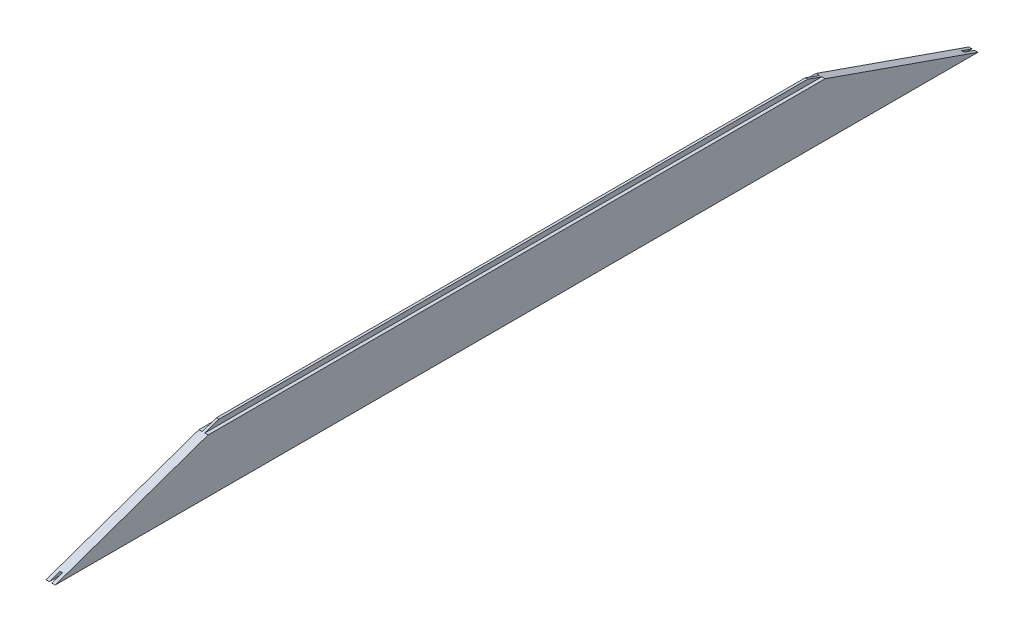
ISO-10303-21;
HEADER;
FILE_DESCRIPTION(('STEP AP214'),'2;1');
FILE_NAME('part.step','',(''),(''),'','','');
FILE_SCHEMA(('AUTOMOTIVE_DESIGN { 1 0 10303 214 1 1 1 1 }'));
ENDSEC;
DATA;
#1=APPLICATION_CONTEXT('core data for automotive mechanical design processes');
#2=APPLICATION_PROTOCOL_DEFINITION('international standard','automotive_design',2000,#1);
#3=PRODUCT_CONTEXT('',#1,'mechanical');
#4=PRODUCT('Part','Part','',(#3));
#5=PRODUCT_RELATED_PRODUCT_CATEGORY('part','',(#4));
#6=PRODUCT_DEFINITION_FORMATION('','',#4);
#7=PRODUCT_DEFINITION_CONTEXT('part definition',#1,'design');
#8=PRODUCT_DEFINITION('design','',#6,#7);
#9=PRODUCT_DEFINITION_SHAPE('','',#8);
#10=(LENGTH_UNIT() NAMED_UNIT(*) SI_UNIT(.MILLI.,.METRE.));
#11=(NAMED_UNIT(*) PLANE_ANGLE_UNIT() SI_UNIT($,.RADIAN.));
#12=(NAMED_UNIT(*) SI_UNIT($,.STERADIAN.) SOLID_ANGLE_UNIT());
#13=UNCERTAINTY_MEASURE_WITH_UNIT(LENGTH_MEASURE(1.E-05),#10,'distance_accuracy_value','');
#14=(GEOMETRIC_REPRESENTATION_CONTEXT(3) GLOBAL_UNCERTAINTY_ASSIGNED_CONTEXT((#13)) GLOBAL_UNIT_ASSIGNED_CONTEXT((#10,
#11,#12)) REPRESENTATION_CONTEXT('',''));
#15=CARTESIAN_POINT('',(0.,0.,0.));
#16=DIRECTION('',(0.,0.,1.));
#17=DIRECTION('',(1.,0.,0.));
#18=AXIS2_PLACEMENT_3D('',#15,#16,#17);
#19=CARTESIAN_POINT('',(0.,43.5,1500.));
#20=DIRECTION('',(0.,1.,0.));
#21=DIRECTION('',(0.,0.,1.));
#22=AXIS2_PLACEMENT_3D('',#19,#20,#21);
#23=PLANE('',#22);
#24=DIRECTION('',(0.,0.,-1.));
#25=VECTOR('',#24,1.);
#26=CARTESIAN_POINT('',(7.5,43.5,1500.));
#27=LINE('',#26,#25);
#28=CARTESIAN_POINT('',(7.50000000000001,43.5,1251.42792834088));
#29=VERTEX_POINT('',#28);
#30=CARTESIAN_POINT('',(7.50000000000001,43.5,248.572071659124));
#31=VERTEX_POINT('',#30);
#32=EDGE_CURVE('E199',#29,#31,#27,.T.);
#33=ORIENTED_EDGE('',*,*,#32,.T.);
#34=DIRECTION('',(-1.,0.,0.));
#35=VECTOR('',#34,1.);
#36=CARTESIAN_POINT('',(0.,43.5,248.572071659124));
#37=LINE('',#36,#35);
#38=CARTESIAN_POINT('',(2.,43.5,248.572071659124));
#39=VERTEX_POINT('',#38);
#40=EDGE_CURVE('E171',#31,#39,#37,.T.);
#41=ORIENTED_EDGE('',*,*,#40,.T.);
#42=DIRECTION('',(0.,0.,-1.));
#43=VECTOR('',#42,1.);
#44=CARTESIAN_POINT('',(2.,43.5,1500.));
#45=LINE('',#44,#43);
#46=CARTESIAN_POINT('',(2.,43.5,1251.42792834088));
#47=VERTEX_POINT('',#46);
#48=EDGE_CURVE('E11',#47,#39,#45,.T.);
#49=ORIENTED_EDGE('',*,*,#48,.F.);
#50=DIRECTION('',(-1.,0.,0.));
#51=VECTOR('',#50,1.);
#52=CARTESIAN_POINT('',(0.,43.5,1251.42792834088));
#53=LINE('',#52,#51);
#54=EDGE_CURVE('E128',#29,#47,#53,.T.);
#55=ORIENTED_EDGE('',*,*,#54,.F.);
#56=EDGE_LOOP('',(#33,#41,#49,#55));
#57=FACE_BOUND('',#56,.T.);
#58=ADVANCED_FACE('F32',(#57),#23,.T.);
#59=CARTESIAN_POINT('',(2.00000000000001,0.,1500.));
#60=DIRECTION('',(1.,0.,0.));
#61=DIRECTION('',(0.,1.,0.));
#62=AXIS2_PLACEMENT_3D('',#59,#60,#61);
#63=PLANE('',#62);
#64=ORIENTED_EDGE('',*,*,#48,.T.);
#65=DIRECTION('',(0.,0.330349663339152,0.943858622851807));
#66=VECTOR('',#65,1.);
#67=CARTESIAN_POINT('',(1.99999999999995,428.952261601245,1349.86709685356));
#68=LINE('',#67,#66);
#69=CARTESIAN_POINT('',(2.,51.5000000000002,271.429273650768));
#70=VERTEX_POINT('',#69);
#71=EDGE_CURVE('E169',#39,#70,#68,.T.);
#72=ORIENTED_EDGE('',*,*,#71,.T.);
#73=DIRECTION('',(0.,0.,-1.));
#74=VECTOR('',#73,1.);
#75=CARTESIAN_POINT('',(2.,51.5,1500.));
#76=LINE('',#75,#74);
#77=CARTESIAN_POINT('',(2.,51.5,1228.57072634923));
#78=VERTEX_POINT('',#77);
#79=EDGE_CURVE('E41',#78,#70,#76,.T.);
#80=ORIENTED_EDGE('',*,*,#79,.F.);
#81=DIRECTION('',(0.,0.330349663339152,-0.943858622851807));
#82=VECTOR('',#81,1.);
#83=CARTESIAN_POINT('',(2.00000000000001,-38.7528058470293,1486.436553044));
#84=LINE('',#83,#82);
#85=EDGE_CURVE('E167',#47,#78,#84,.T.);
#86=ORIENTED_EDGE('',*,*,#85,.F.);
#87=EDGE_LOOP('',(#64,#72,#80,#86));
#88=FACE_BOUND('',#87,.T.);
#89=ADVANCED_FACE('F34',(#88),#63,.T.);
#90=CARTESIAN_POINT('',(0.,51.5,1500.));
#91=DIRECTION('',(0.,1.,0.));
#92=DIRECTION('',(0.,0.,1.));
#93=AXIS2_PLACEMENT_3D('',#90,#91,#92);
#94=PLANE('',#93);
#95=ORIENTED_EDGE('',*,*,#79,.T.);
#96=DIRECTION('',(1.,0.,0.));
#97=VECTOR('',#96,1.);
#98=CARTESIAN_POINT('',(-7.5,51.5000000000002,271.429273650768));
#99=LINE('',#98,#97);
#100=CARTESIAN_POINT('',(-2.,51.5000000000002,271.429273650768));
#101=VERTEX_POINT('',#100);
#102=EDGE_CURVE('E140',#101,#70,#99,.T.);
#103=ORIENTED_EDGE('',*,*,#102,.F.);
#104=DIRECTION('',(0.,0.,-1.));
#105=VECTOR('',#104,1.);
#106=CARTESIAN_POINT('',(-2.,51.5,1500.));
#107=LINE('',#106,#105);
#108=CARTESIAN_POINT('',(-2.,51.5,1228.57072634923));
#109=VERTEX_POINT('',#108);
#110=EDGE_CURVE('E154',#109,#101,#107,.T.);
#111=ORIENTED_EDGE('',*,*,#110,.F.);
#112=DIRECTION('',(1.,0.,0.));
#113=VECTOR('',#112,1.);
#114=CARTESIAN_POINT('',(-7.5,51.5,1228.57072634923));
#115=LINE('',#114,#113);
#116=EDGE_CURVE('E163',#109,#78,#115,.T.);
#117=ORIENTED_EDGE('',*,*,#116,.T.);
#118=EDGE_LOOP('',(#95,#103,#111,#117));
#119=FACE_BOUND('',#118,.T.);
#120=ADVANCED_FACE('F161',(#119),#94,.T.);
#121=CARTESIAN_POINT('',(-1.99999999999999,0.,1500.));
#122=DIRECTION('',(1.,0.,0.));
#123=DIRECTION('',(0.,1.,0.));
#124=AXIS2_PLACEMENT_3D('',#121,#122,#123);
#125=PLANE('',#124);
#126=DIRECTION('',(0.,0.330349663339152,0.943858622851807));
#127=VECTOR('',#126,1.);
#128=CARTESIAN_POINT('',(-2.00000000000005,428.952261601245,1349.86709685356));
#129=LINE('',#128,#127);
#130=CARTESIAN_POINT('',(-2.,43.5,248.572071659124));
#131=VERTEX_POINT('',#130);
#132=EDGE_CURVE('E172',#131,#101,#129,.T.);
#133=ORIENTED_EDGE('',*,*,#132,.F.);
#134=DIRECTION('',(0.,0.,-1.));
#135=VECTOR('',#134,1.);
#136=CARTESIAN_POINT('',(-2.,43.5,1500.));
#137=LINE('',#136,#135);
#138=CARTESIAN_POINT('',(-2.,43.5,1251.42792834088));
#139=VERTEX_POINT('',#138);
#140=EDGE_CURVE('E146',#139,#131,#137,.T.);
#141=ORIENTED_EDGE('',*,*,#140,.F.);
#142=DIRECTION('',(0.,0.330349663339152,-0.943858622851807));
#143=VECTOR('',#142,1.);
#144=CARTESIAN_POINT('',(-1.99999999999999,-38.7528058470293,1486.436553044));
#145=LINE('',#144,#143);
#146=EDGE_CURVE('E192',#139,#109,#145,.T.);
#147=ORIENTED_EDGE('',*,*,#146,.T.);
#148=ORIENTED_EDGE('',*,*,#110,.T.);
#149=EDGE_LOOP('',(#133,#141,#147,#148));
#150=FACE_BOUND('',#149,.T.);
#151=ADVANCED_FACE('F230',(#150),#125,.F.);
#152=ORIENTED_EDGE('',*,*,#140,.T.);
#153=DIRECTION('',(-1.,0.,0.));
#154=VECTOR('',#153,1.);
#155=CARTESIAN_POINT('',(0.,43.5,248.572071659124));
#156=LINE('',#155,#154);
#157=CARTESIAN_POINT('',(-7.5,43.5,248.572071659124));
#158=VERTEX_POINT('',#157);
#159=EDGE_CURVE('E176',#131,#158,#156,.T.);
#160=ORIENTED_EDGE('',*,*,#159,.T.);
#161=DIRECTION('',(0.,0.,-1.));
#162=VECTOR('',#161,1.);
#163=CARTESIAN_POINT('',(-7.5,43.5,1500.));
#164=LINE('',#163,#162);
#165=CARTESIAN_POINT('',(-7.5,43.5,1251.42792834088));
#166=VERTEX_POINT('',#165);
#167=EDGE_CURVE('E138',#166,#158,#164,.T.);
#168=ORIENTED_EDGE('',*,*,#167,.F.);
#169=DIRECTION('',(-1.,0.,0.));
#170=VECTOR('',#169,1.);
#171=CARTESIAN_POINT('',(0.,43.5,1251.42792834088));
#172=LINE('',#171,#170);
#173=EDGE_CURVE('E190',#139,#166,#172,.T.);
#174=ORIENTED_EDGE('',*,*,#173,.F.);
#175=EDGE_LOOP('',(#152,#160,#168,#174));
#176=FACE_BOUND('',#175,.T.);
#177=ADVANCED_FACE('F233',(#176),#23,.T.);
#178=CARTESIAN_POINT('',(-7.5,0.,1500.));
#179=DIRECTION('',(1.,0.,0.));
#180=DIRECTION('',(0.,1.,0.));
#181=AXIS2_PLACEMENT_3D('',#178,#179,#180);
#182=PLANE('',#181);
#183=DIRECTION('',(0.,0.330349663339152,0.943858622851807));
#184=VECTOR('',#183,1.);
#185=CARTESIAN_POINT('',(-7.5,-43.5,0.));
#186=LINE('',#185,#184);
#187=CARTESIAN_POINT('',(-7.5,-43.5,0.));
#188=VERTEX_POINT('',#187);
#189=EDGE_CURVE('E119',#188,#158,#186,.T.);
#190=ORIENTED_EDGE('',*,*,#189,.F.);
#191=DIRECTION('',(0.,0.,-1.));
#192=VECTOR('',#191,1.);
#193=CARTESIAN_POINT('',(-7.49999999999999,-43.5,1500.));
#194=LINE('',#193,#192);
#195=CARTESIAN_POINT('',(-7.5,-43.5,1500.));
#196=VERTEX_POINT('',#195);
#197=EDGE_CURVE('E135',#196,#188,#194,.T.);
#198=ORIENTED_EDGE('',*,*,#197,.F.);
#199=DIRECTION('',(0.,0.330349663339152,-0.943858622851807));
#200=VECTOR('',#199,1.);
#201=CARTESIAN_POINT('',(-7.5,-43.5,1500.));
#202=LINE('',#201,#200);
#203=EDGE_CURVE('E181',#196,#166,#202,.T.);
#204=ORIENTED_EDGE('',*,*,#203,.T.);
#205=ORIENTED_EDGE('',*,*,#167,.T.);
#206=EDGE_LOOP('',(#190,#198,#204,#205));
#207=FACE_BOUND('',#206,.T.);
#208=ADVANCED_FACE('F133',(#207),#182,.F.);
#209=CARTESIAN_POINT('',(-2.,0.,1500.));
#210=DIRECTION('',(1.,0.,0.));
#211=DIRECTION('',(0.,1.,0.));
#212=AXIS2_PLACEMENT_3D('',#209,#210,#211);
#213=PLANE('',#212);
#214=DIRECTION('',(0.,0.,-1.));
#215=VECTOR('',#214,1.);
#216=CARTESIAN_POINT('',(-2.,-43.5,1500.));
#217=LINE('',#216,#215);
#218=CARTESIAN_POINT('',(-2.,-43.5,1500.));
#219=VERTEX_POINT('',#218);
#220=CARTESIAN_POINT('',(-2.,-43.5,0.));
#221=VERTEX_POINT('',#220);
#222=EDGE_CURVE('E144',#219,#221,#217,.T.);
#223=ORIENTED_EDGE('',*,*,#222,.T.);
#224=DIRECTION('',(0.,0.330349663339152,0.943858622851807));
#225=VECTOR('',#224,1.);
#226=CARTESIAN_POINT('',(-2.00000000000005,428.952261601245,1349.86709685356));
#227=LINE('',#226,#225);
#228=CARTESIAN_POINT('',(-2.,-37.5,17.1429014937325));
#229=VERTEX_POINT('',#228);
#230=EDGE_CURVE('E122',#221,#229,#227,.T.);
#231=ORIENTED_EDGE('',*,*,#230,.T.);
#232=DIRECTION('',(0.,0.,-1.));
#233=VECTOR('',#232,1.);
#234=CARTESIAN_POINT('',(-2.,-37.5,1500.));
#235=LINE('',#234,#233);
#236=CARTESIAN_POINT('',(-2.,-37.5,1482.85709850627));
#237=VERTEX_POINT('',#236);
#238=EDGE_CURVE('E148',#237,#229,#235,.T.);
#239=ORIENTED_EDGE('',*,*,#238,.F.);
#240=DIRECTION('',(0.,0.330349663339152,-0.943858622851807));
#241=VECTOR('',#240,1.);
#242=CARTESIAN_POINT('',(-2.,-38.7528058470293,1486.436553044));
#243=LINE('',#242,#241);
#244=EDGE_CURVE('E188',#219,#237,#243,.T.);
#245=ORIENTED_EDGE('',*,*,#244,.F.);
#246=EDGE_LOOP('',(#223,#231,#239,#245));
#247=FACE_BOUND('',#246,.T.);
#248=ADVANCED_FACE('F219',(#247),#213,.T.);
#249=CARTESIAN_POINT('',(0.,-37.5,1500.));
#250=DIRECTION('',(0.,1.,0.));
#251=DIRECTION('',(0.,0.,1.));
#252=AXIS2_PLACEMENT_3D('',#249,#250,#251);
#253=PLANE('',#252);
#254=DIRECTION('',(-1.,0.,0.));
#255=VECTOR('',#254,1.);
#256=CARTESIAN_POINT('',(0.,-37.5,17.1429014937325));
#257=LINE('',#256,#255);
#258=CARTESIAN_POINT('',(2.,-37.5,17.1429014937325));
#259=VERTEX_POINT('',#258);
#260=EDGE_CURVE('E216',#259,#229,#257,.T.);
#261=ORIENTED_EDGE('',*,*,#260,.F.);
#262=DIRECTION('',(0.,0.,-1.));
#263=VECTOR('',#262,1.);
#264=CARTESIAN_POINT('',(2.,-37.5,1500.));
#265=LINE('',#264,#263);
#266=CARTESIAN_POINT('',(2.,-37.5,1482.85709850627));
#267=VERTEX_POINT('',#266);
#268=EDGE_CURVE('E208',#267,#259,#265,.T.);
#269=ORIENTED_EDGE('',*,*,#268,.F.);
#270=DIRECTION('',(-1.,0.,0.));
#271=VECTOR('',#270,1.);
#272=CARTESIAN_POINT('',(0.,-37.5,1482.85709850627));
#273=LINE('',#272,#271);
#274=EDGE_CURVE('E185',#267,#237,#273,.T.);
#275=ORIENTED_EDGE('',*,*,#274,.T.);
#276=ORIENTED_EDGE('',*,*,#238,.T.);
#277=EDGE_LOOP('',(#261,#269,#275,#276));
#278=FACE_BOUND('',#277,.T.);
#279=ADVANCED_FACE('F214',(#278),#253,.F.);
#280=CARTESIAN_POINT('',(2.,0.,1500.));
#281=DIRECTION('',(1.,0.,0.));
#282=DIRECTION('',(0.,1.,0.));
#283=AXIS2_PLACEMENT_3D('',#280,#281,#282);
#284=PLANE('',#283);
#285=DIRECTION('',(0.,0.330349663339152,0.943858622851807));
#286=VECTOR('',#285,1.);
#287=CARTESIAN_POINT('',(1.99999999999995,428.952261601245,1349.86709685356));
#288=LINE('',#287,#286);
#289=CARTESIAN_POINT('',(2.,-43.5,0.));
#290=VERTEX_POINT('',#289);
#291=EDGE_CURVE('E221',#290,#259,#288,.T.);
#292=ORIENTED_EDGE('',*,*,#291,.F.);
#293=DIRECTION('',(0.,0.,-1.));
#294=VECTOR('',#293,1.);
#295=CARTESIAN_POINT('',(2.,-43.5,1500.));
#296=LINE('',#295,#294);
#297=CARTESIAN_POINT('',(2.,-43.5,1500.));
#298=VERTEX_POINT('',#297);
#299=EDGE_CURVE('E205',#298,#290,#296,.T.);
#300=ORIENTED_EDGE('',*,*,#299,.F.);
#301=DIRECTION('',(0.,0.330349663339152,-0.943858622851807));
#302=VECTOR('',#301,1.);
#303=CARTESIAN_POINT('',(2.,-38.7528058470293,1486.436553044));
#304=LINE('',#303,#302);
#305=EDGE_CURVE('E47',#298,#267,#304,.T.);
#306=ORIENTED_EDGE('',*,*,#305,.T.);
#307=ORIENTED_EDGE('',*,*,#268,.T.);
#308=EDGE_LOOP('',(#292,#300,#306,#307));
#309=FACE_BOUND('',#308,.T.);
#310=ADVANCED_FACE('F246',(#309),#284,.F.);
#311=CARTESIAN_POINT('',(7.5,0.,1500.));
#312=DIRECTION('',(1.,0.,0.));
#313=DIRECTION('',(0.,1.,0.));
#314=AXIS2_PLACEMENT_3D('',#311,#312,#313);
#315=PLANE('',#314);
#316=DIRECTION('',(0.,0.,-1.));
#317=VECTOR('',#316,1.);
#318=CARTESIAN_POINT('',(7.50000000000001,-43.5,1500.));
#319=LINE('',#318,#317);
#320=CARTESIAN_POINT('',(7.50000000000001,-43.5,1500.));
#321=VERTEX_POINT('',#320);
#322=CARTESIAN_POINT('',(7.50000000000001,-43.5,0.));
#323=VERTEX_POINT('',#322);
#324=EDGE_CURVE('E202',#321,#323,#319,.T.);
#325=ORIENTED_EDGE('',*,*,#324,.T.);
#326=DIRECTION('',(0.,0.330349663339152,0.943858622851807));
#327=VECTOR('',#326,1.);
#328=CARTESIAN_POINT('',(7.50000000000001,-43.5,0.));
#329=LINE('',#328,#327);
#330=EDGE_CURVE('E139',#323,#31,#329,.T.);
#331=ORIENTED_EDGE('',*,*,#330,.T.);
#332=ORIENTED_EDGE('',*,*,#32,.F.);
#333=DIRECTION('',(0.,0.330349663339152,-0.943858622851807));
#334=VECTOR('',#333,1.);
#335=CARTESIAN_POINT('',(7.50000000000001,-43.5,1500.));
#336=LINE('',#335,#334);
#337=EDGE_CURVE('E174',#321,#29,#336,.T.);
#338=ORIENTED_EDGE('',*,*,#337,.F.);
#339=EDGE_LOOP('',(#325,#331,#332,#338));
#340=FACE_BOUND('',#339,.T.);
#341=ADVANCED_FACE('F240',(#340),#315,.T.);
#342=CARTESIAN_POINT('',(0.,-43.5,1500.));
#343=DIRECTION('',(0.,1.,0.));
#344=DIRECTION('',(0.,0.,1.));
#345=AXIS2_PLACEMENT_3D('',#342,#343,#344);
#346=PLANE('',#345);
#347=DIRECTION('',(1.,0.,0.));
#348=VECTOR('',#347,1.);
#349=CARTESIAN_POINT('',(0.,-43.5,0.));
#350=LINE('',#349,#348);
#351=EDGE_CURVE('E116',#188,#221,#350,.T.);
#352=ORIENTED_EDGE('',*,*,#351,.T.);
#353=ORIENTED_EDGE('',*,*,#222,.F.);
#354=DIRECTION('',(1.,0.,0.));
#355=VECTOR('',#354,1.);
#356=CARTESIAN_POINT('',(0.,-43.5,1500.));
#357=LINE('',#356,#355);
#358=EDGE_CURVE('E143',#196,#219,#357,.T.);
#359=ORIENTED_EDGE('',*,*,#358,.F.);
#360=ORIENTED_EDGE('',*,*,#197,.T.);
#361=EDGE_LOOP('',(#352,#353,#359,#360));
#362=FACE_BOUND('',#361,.T.);
#363=ADVANCED_FACE('F142',(#362),#346,.F.);
#364=EDGE_CURVE('E127',#290,#323,#350,.T.);
#365=ORIENTED_EDGE('',*,*,#364,.T.);
#366=ORIENTED_EDGE('',*,*,#324,.F.);
#367=EDGE_CURVE('E197',#298,#321,#357,.T.);
#368=ORIENTED_EDGE('',*,*,#367,.F.);
#369=ORIENTED_EDGE('',*,*,#299,.T.);
#370=EDGE_LOOP('',(#365,#366,#368,#369));
#371=FACE_BOUND('',#370,.T.);
#372=ADVANCED_FACE('F248',(#371),#346,.F.);
#373=CARTESIAN_POINT('',(-7.5,-43.5,1500.));
#374=DIRECTION('',(0.,-0.943858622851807,-0.330349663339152));
#375=DIRECTION('',(0.,0.330349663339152,-0.943858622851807));
#376=AXIS2_PLACEMENT_3D('',#373,#374,#375);
#377=PLANE('',#376);
#378=ORIENTED_EDGE('',*,*,#54,.T.);
#379=ORIENTED_EDGE('',*,*,#85,.T.);
#380=ORIENTED_EDGE('',*,*,#116,.F.);
#381=ORIENTED_EDGE('',*,*,#146,.F.);
#382=ORIENTED_EDGE('',*,*,#173,.T.);
#383=ORIENTED_EDGE('',*,*,#203,.F.);
#384=ORIENTED_EDGE('',*,*,#358,.T.);
#385=ORIENTED_EDGE('',*,*,#244,.T.);
#386=ORIENTED_EDGE('',*,*,#274,.F.);
#387=ORIENTED_EDGE('',*,*,#305,.F.);
#388=ORIENTED_EDGE('',*,*,#367,.T.);
#389=ORIENTED_EDGE('',*,*,#337,.T.);
#390=EDGE_LOOP('',(#378,#379,#380,#381,#382,#383,#384,#385,#386,#387,#388,#389));
#391=FACE_BOUND('',#390,.T.);
#392=ADVANCED_FACE('F234',(#391),#377,.F.);
#393=CARTESIAN_POINT('',(-7.5,-43.5,0.));
#394=DIRECTION('',(0.,0.943858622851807,-0.330349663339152));
#395=DIRECTION('',(0.,0.330349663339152,0.943858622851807));
#396=AXIS2_PLACEMENT_3D('',#393,#394,#395);
#397=PLANE('',#396);
#398=ORIENTED_EDGE('',*,*,#330,.F.);
#399=ORIENTED_EDGE('',*,*,#364,.F.);
#400=ORIENTED_EDGE('',*,*,#291,.T.);
#401=ORIENTED_EDGE('',*,*,#260,.T.);
#402=ORIENTED_EDGE('',*,*,#230,.F.);
#403=ORIENTED_EDGE('',*,*,#351,.F.);
#404=ORIENTED_EDGE('',*,*,#189,.T.);
#405=ORIENTED_EDGE('',*,*,#159,.F.);
#406=ORIENTED_EDGE('',*,*,#132,.T.);
#407=ORIENTED_EDGE('',*,*,#102,.T.);
#408=ORIENTED_EDGE('',*,*,#71,.F.);
#409=ORIENTED_EDGE('',*,*,#40,.F.);
#410=EDGE_LOOP('',(#398,#399,#400,#401,#402,#403,#404,#405,#406,#407,#408,#409));
#411=FACE_BOUND('',#410,.T.);
#412=ADVANCED_FACE('F118',(#411),#397,.T.);
#413=CLOSED_SHELL('',(#58,#89,#120,#151,#177,#208,#248,#279,#310,#341,#363,#372,#392,#412));
#414=MANIFOLD_SOLID_BREP('B2',#413);
#415=ADVANCED_BREP_SHAPE_REPRESENTATION('',(#18,#414),#14);
#416=SHAPE_DEFINITION_REPRESENTATION(#9,#415);
ENDSEC;
END-ISO-10303-21;
